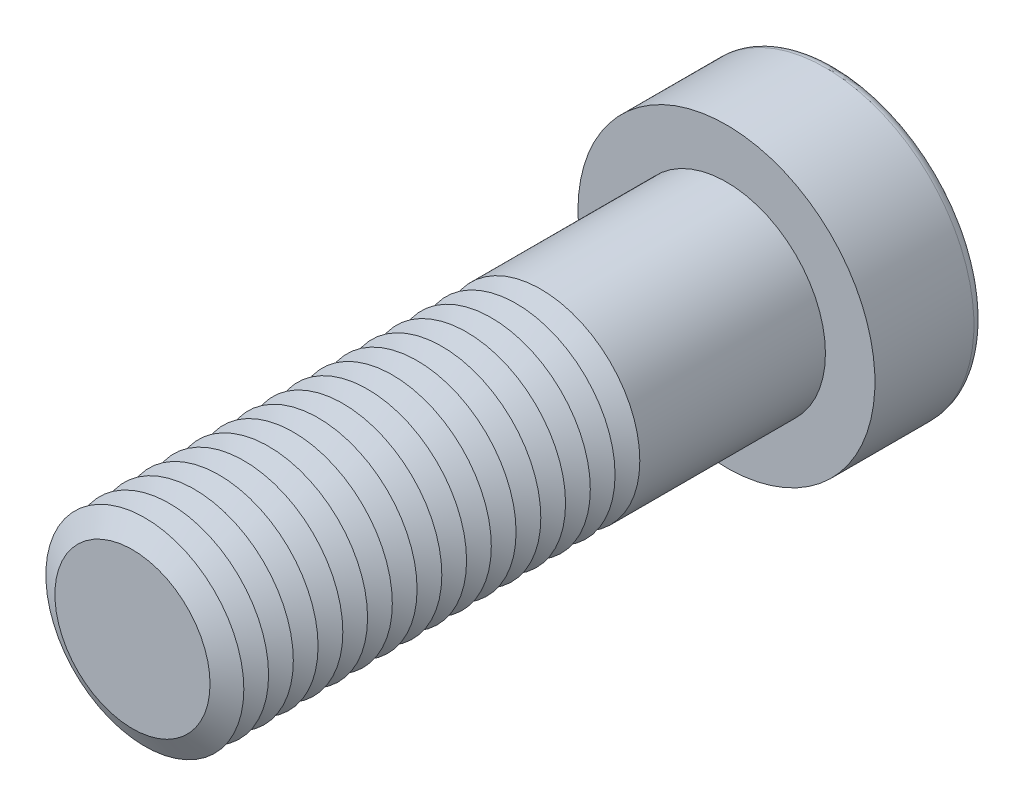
from build123d import *

# Parameters (mm, degrees)
SKETCH1_R           = 10
BOSS_EXTRUDE1_DEPTH = 60
SKETCH2_R           = 15
BOSS_EXTRUDE2_DEPTH = 11
CUT_EXTRUDE1_DEPTH  = 10.5
FILLET1_R           = 1
LPATTERN1_COUNT     = 17
LPATTERN1_PITCH     = 2.5


with BuildPart() as part:
    # Sketch1 → Boss-Extrude1 (new body)
    with BuildSketch(Plane.XY):
        Circle(SKETCH1_R)
    extrude(amount=BOSS_EXTRUDE1_DEPTH)

    # Sketch2 → Boss-Extrude2 (add)
    with BuildSketch(Plane(origin=(0, 0, 0), x_dir=(-1, 0, 0), z_dir=(0, 0, -1))):
        Circle(SKETCH2_R)
    extrude(amount=BOSS_EXTRUDE2_DEPTH)

    # Sketch3 → Cut-Extrude1 (cut)
    with BuildSketch(Plane(origin=(0, 0, -11), x_dir=(-1, 0, 0), z_dir=(0, 0, -1))):
        Polygon((-4.041451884, 7), (-8.082903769, 0), (-4.041451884, -7), (4.041451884, -7), (8.082903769, 0), (4.041451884, 7), align=None)
    extrude(amount=-CUT_EXTRUDE1_DEPTH, mode=Mode.SUBTRACT)

    # Fillet1
    fillet1_edges = [part.edges().sort_by_distance(p)[0] for p in [
        (15, 0, -11),
    ]]
    fillet(fillet1_edges, radius=FILLET1_R)

    # Cut-Extrude2 cone 1 section (on through the dimple's axis) → Cut-Extrude2 (revolve, cut)
    with BuildSketch(Plane(origin=(0, 0, -0.5), x_dir=(0, 1, 0), z_dir=(1, 0, 0))):
        Polygon((0, 0), (7, 0), (0, 4.041451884), align=None)
    revolve(axis=Axis((0, 0, -0.5), (0, 0, 1)), mode=Mode.SUBTRACT)

    # Cut-Extrude3 cone 1 section (on through the dimple's axis) → Cut-Extrude3 (revolve, cut)
    with BuildSketch(Plane(origin=(0, 0, -11), x_dir=(0, 1, 0), z_dir=(1, 0, 0))):
        Polygon((0, 0), (8.082903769, 0), (0, 2.165807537), align=None)
    revolve(axis=Axis((0, 0, -11), (0, 0, 1)), mode=Mode.SUBTRACT)

    # Sketch7 → Cut-Revolve1 (revolve, cut)
    with BuildSketch(Plane(origin=(0, 0, 0), x_dir=(0, 0, -1), z_dir=(1, 0, 0)), mode=Mode.PRIVATE) as cut_revolve1_sk:
        Polygon((-60, 7.834936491), (-58.75, 10), (-61.25, 10), align=None)
    cut_revolve1 = revolve(cut_revolve1_sk.sketch.rotate(Axis((0, 0, 60), (0, 0, -1)), 90), axis=Axis((0, 0, 60), (0, 0, -1)), mode=Mode.SUBTRACT)

    # LPattern1: Cut-Revolve1 ×17
    with Locations(*[(0, 0, -i * LPATTERN1_PITCH) for i in range(1, LPATTERN1_COUNT)]):
        add(cut_revolve1, mode=Mode.SUBTRACT)


solid = part.part
